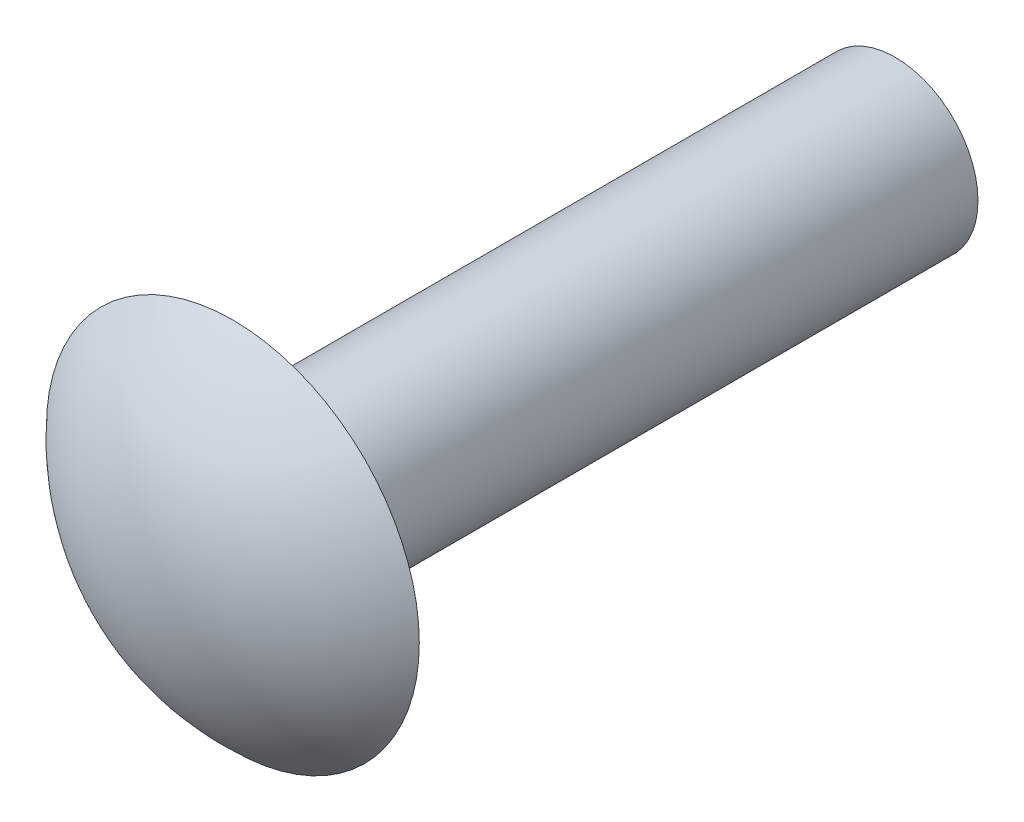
ISO-10303-21;
HEADER;
FILE_DESCRIPTION(('STEP AP214'),'2;1');
FILE_NAME('part.step','',(''),(''),'','','');
FILE_SCHEMA(('AUTOMOTIVE_DESIGN { 1 0 10303 214 1 1 1 1 }'));
ENDSEC;
DATA;
#1=APPLICATION_CONTEXT('core data for automotive mechanical design processes');
#2=APPLICATION_PROTOCOL_DEFINITION('international standard','automotive_design',2000,#1);
#3=PRODUCT_CONTEXT('',#1,'mechanical');
#4=PRODUCT('Part','Part','',(#3));
#5=PRODUCT_RELATED_PRODUCT_CATEGORY('part','',(#4));
#6=PRODUCT_DEFINITION_FORMATION('','',#4);
#7=PRODUCT_DEFINITION_CONTEXT('part definition',#1,'design');
#8=PRODUCT_DEFINITION('design','',#6,#7);
#9=PRODUCT_DEFINITION_SHAPE('','',#8);
#10=(LENGTH_UNIT() NAMED_UNIT(*) SI_UNIT(.MILLI.,.METRE.));
#11=(NAMED_UNIT(*) PLANE_ANGLE_UNIT() SI_UNIT($,.RADIAN.));
#12=(NAMED_UNIT(*) SI_UNIT($,.STERADIAN.) SOLID_ANGLE_UNIT());
#13=UNCERTAINTY_MEASURE_WITH_UNIT(LENGTH_MEASURE(1.E-05),#10,'distance_accuracy_value','');
#14=(GEOMETRIC_REPRESENTATION_CONTEXT(3) GLOBAL_UNCERTAINTY_ASSIGNED_CONTEXT((#13)) GLOBAL_UNIT_ASSIGNED_CONTEXT((#10,
#11,#12)) REPRESENTATION_CONTEXT('',''));
#15=CARTESIAN_POINT('',(0.,0.,0.));
#16=DIRECTION('',(0.,0.,1.));
#17=DIRECTION('',(1.,0.,0.));
#18=AXIS2_PLACEMENT_3D('',#15,#16,#17);
#19=CARTESIAN_POINT('',(0.,0.,-9.6385126));
#20=DIRECTION('',(0.,0.,1.));
#21=DIRECTION('',(-1.,0.,0.));
#22=AXIS2_PLACEMENT_3D('',#19,#20,#21);
#23=SPHERICAL_SURFACE('',#22,9.6385126);
#24=CARTESIAN_POINT('',(0.,0.,-3.175));
#25=DIRECTION('',(0.,0.,1.));
#26=DIRECTION('',(1.,0.,0.));
#27=AXIS2_PLACEMENT_3D('',#24,#25,#26);
#28=CIRCLE('',#27,7.1501);
#29=CARTESIAN_POINT('',(7.1501,0.,-3.175));
#30=VERTEX_POINT('',#29);
#31=EDGE_CURVE('E50',#30,#30,#28,.T.);
#32=ORIENTED_EDGE('',*,*,#31,.T.);
#33=EDGE_LOOP('',(#32));
#34=FACE_BOUND('',#33,.T.);
#35=ADVANCED_FACE('F40',(#34),#23,.T.);
#36=CARTESIAN_POINT('',(0.,0.,-28.575));
#37=DIRECTION('',(0.,0.,1.));
#38=DIRECTION('',(1.,0.,0.));
#39=AXIS2_PLACEMENT_3D('',#36,#37,#38);
#40=PLANE('',#39);
#41=CARTESIAN_POINT('',(0.,0.,-28.575));
#42=DIRECTION('',(0.,0.,1.));
#43=DIRECTION('',(1.,0.,0.));
#44=AXIS2_PLACEMENT_3D('',#41,#42,#43);
#45=CIRCLE('',#44,3.175);
#46=CARTESIAN_POINT('',(3.175,0.,-28.575));
#47=VERTEX_POINT('',#46);
#48=EDGE_CURVE('E10',#47,#47,#45,.T.);
#49=ORIENTED_EDGE('',*,*,#48,.F.);
#50=EDGE_LOOP('',(#49));
#51=FACE_BOUND('',#50,.T.);
#52=ADVANCED_FACE('F65',(#51),#40,.F.);
#53=CARTESIAN_POINT('',(0.,0.,0.));
#54=DIRECTION('',(0.,0.,1.));
#55=DIRECTION('',(1.,0.,0.));
#56=AXIS2_PLACEMENT_3D('',#53,#54,#55);
#57=CYLINDRICAL_SURFACE('',#56,3.175);
#58=CARTESIAN_POINT('',(0.,0.,-3.175));
#59=DIRECTION('',(0.,0.,1.));
#60=DIRECTION('',(1.,0.,0.));
#61=AXIS2_PLACEMENT_3D('',#58,#59,#60);
#62=CIRCLE('',#61,3.175);
#63=CARTESIAN_POINT('',(3.175,0.,-3.175));
#64=VERTEX_POINT('',#63);
#65=EDGE_CURVE('E43',#64,#64,#62,.T.);
#66=ORIENTED_EDGE('',*,*,#65,.F.);
#67=EDGE_LOOP('',(#66));
#68=FACE_BOUND('',#67,.T.);
#69=ORIENTED_EDGE('',*,*,#48,.T.);
#70=EDGE_LOOP('',(#69));
#71=FACE_BOUND('',#70,.T.);
#72=ADVANCED_FACE('F60',(#68,#71),#57,.T.);
#73=CARTESIAN_POINT('',(-7.1501,0.,-3.175));
#74=DIRECTION('',(0.,0.,1.));
#75=DIRECTION('',(1.,0.,0.));
#76=AXIS2_PLACEMENT_3D('',#73,#74,#75);
#77=PLANE('',#76);
#78=ORIENTED_EDGE('',*,*,#31,.F.);
#79=EDGE_LOOP('',(#78));
#80=FACE_BOUND('',#79,.T.);
#81=ORIENTED_EDGE('',*,*,#65,.T.);
#82=EDGE_LOOP('',(#81));
#83=FACE_BOUND('',#82,.T.);
#84=ADVANCED_FACE('F54',(#80,#83),#77,.F.);
#85=CLOSED_SHELL('',(#35,#52,#72,#84));
#86=MANIFOLD_SOLID_BREP('B2',#85);
#87=ADVANCED_BREP_SHAPE_REPRESENTATION('',(#18,#86),#14);
#88=SHAPE_DEFINITION_REPRESENTATION(#9,#87);
ENDSEC;
END-ISO-10303-21;
